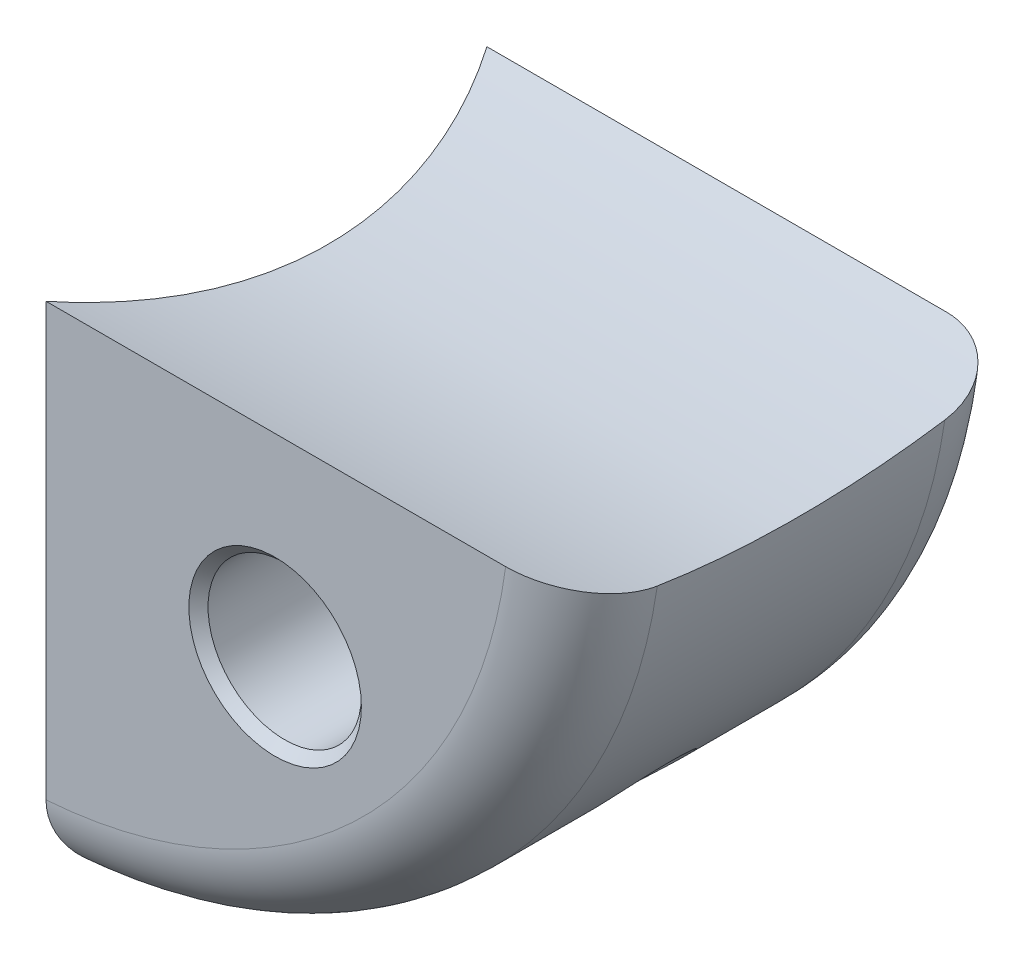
ISO-10303-21;
HEADER;
FILE_DESCRIPTION(('STEP AP214'),'2;1');
FILE_NAME('part.step','',(''),(''),'','','');
FILE_SCHEMA(('AUTOMOTIVE_DESIGN { 1 0 10303 214 1 1 1 1 }'));
ENDSEC;
DATA;
#1=APPLICATION_CONTEXT('core data for automotive mechanical design processes');
#2=APPLICATION_PROTOCOL_DEFINITION('international standard','automotive_design',2000,#1);
#3=PRODUCT_CONTEXT('',#1,'mechanical');
#4=PRODUCT('Part','Part','',(#3));
#5=PRODUCT_RELATED_PRODUCT_CATEGORY('part','',(#4));
#6=PRODUCT_DEFINITION_FORMATION('','',#4);
#7=PRODUCT_DEFINITION_CONTEXT('part definition',#1,'design');
#8=PRODUCT_DEFINITION('design','',#6,#7);
#9=PRODUCT_DEFINITION_SHAPE('','',#8);
#10=(LENGTH_UNIT() NAMED_UNIT(*) SI_UNIT(.MILLI.,.METRE.));
#11=(NAMED_UNIT(*) PLANE_ANGLE_UNIT() SI_UNIT($,.RADIAN.));
#12=(NAMED_UNIT(*) SI_UNIT($,.STERADIAN.) SOLID_ANGLE_UNIT());
#13=UNCERTAINTY_MEASURE_WITH_UNIT(LENGTH_MEASURE(1.E-05),#10,'distance_accuracy_value','');
#14=(GEOMETRIC_REPRESENTATION_CONTEXT(3) GLOBAL_UNCERTAINTY_ASSIGNED_CONTEXT((#13)) GLOBAL_UNIT_ASSIGNED_CONTEXT((#10,
#11,#12)) REPRESENTATION_CONTEXT('',''));
#15=CARTESIAN_POINT('',(0.,0.,0.));
#16=DIRECTION('',(0.,0.,1.));
#17=DIRECTION('',(1.,0.,0.));
#18=AXIS2_PLACEMENT_3D('',#15,#16,#17);
#19=CARTESIAN_POINT('',(0.,0.,23.));
#20=DIRECTION('',(0.,0.,-1.));
#21=DIRECTION('',(-1.,0.,0.));
#22=AXIS2_PLACEMENT_3D('',#19,#20,#21);
#23=CYLINDRICAL_SURFACE('',#22,60.);
#24=CARTESIAN_POINT('',(40.1556464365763,-44.5816560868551,-3.82644013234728));
#25=CARTESIAN_POINT('',(40.0194279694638,-44.7043511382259,-3.66433800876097));
#26=CARTESIAN_POINT('',(39.891639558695,-44.8183199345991,-3.48844085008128));
#27=CARTESIAN_POINT('',(39.6558741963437,-45.027064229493,-3.1133434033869));
#28=CARTESIAN_POINT('',(39.5479159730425,-45.1218215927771,-2.91412137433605));
#29=CARTESIAN_POINT('',(39.3405190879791,-45.3028164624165,-2.4672755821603));
#30=CARTESIAN_POINT('',(39.2444708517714,-45.3859300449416,-2.21679667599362));
#31=CARTESIAN_POINT('',(39.0841918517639,-45.5240287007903,-1.69850117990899));
#32=CARTESIAN_POINT('',(39.0199702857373,-45.5790056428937,-1.43067960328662));
#33=CARTESIAN_POINT('',(38.9237164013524,-45.6612360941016,-0.876837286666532));
#34=CARTESIAN_POINT('',(38.8926884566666,-45.6876248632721,-0.590512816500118));
#35=CARTESIAN_POINT('',(38.8671349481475,-45.7093655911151,-0.015071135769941));
#36=CARTESIAN_POINT('',(38.8726118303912,-45.7047154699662,0.274046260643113));
#37=CARTESIAN_POINT('',(38.9202490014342,-45.6641567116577,0.851163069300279));
#38=CARTESIAN_POINT('',(38.9629243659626,-45.6278091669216,1.13908951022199));
#39=CARTESIAN_POINT('',(39.0844026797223,-45.5237938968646,1.70137422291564));
#40=CARTESIAN_POINT('',(39.1632065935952,-45.4561253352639,1.9757321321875));
#41=CARTESIAN_POINT('',(39.3540106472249,-45.2910321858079,2.50117283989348));
#42=CARTESIAN_POINT('',(39.4658129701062,-45.1937848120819,2.75238295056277));
#43=CARTESIAN_POINT('',(39.7193724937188,-44.9710997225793,3.22552059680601));
#44=CARTESIAN_POINT('',(39.8611261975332,-44.8456652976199,3.44745154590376));
#45=CARTESIAN_POINT('',(40.166081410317,-44.5727113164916,3.84935488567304));
#46=CARTESIAN_POINT('',(40.3286336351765,-44.4258466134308,4.03026374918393));
#47=CARTESIAN_POINT('',(40.6727442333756,-44.1110201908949,4.35100856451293));
#48=CARTESIAN_POINT('',(40.8542978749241,-43.9430637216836,4.49085470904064));
#49=CARTESIAN_POINT('',(41.2230256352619,-43.5972873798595,4.71968777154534));
#50=CARTESIAN_POINT('',(41.4097005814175,-43.4201120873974,4.81045321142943));
#51=CARTESIAN_POINT('',(41.7891600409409,-43.055026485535,4.94590233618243));
#52=CARTESIAN_POINT('',(41.9819431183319,-42.8671186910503,4.99059677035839));
#53=CARTESIAN_POINT('',(42.3609745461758,-42.4925457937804,5.03149968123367));
#54=CARTESIAN_POINT('',(42.5472236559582,-42.306053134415,5.02929502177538));
#55=CARTESIAN_POINT('',(42.9143273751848,-41.9336245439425,4.98037546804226));
#56=CARTESIAN_POINT('',(43.095182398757,-41.7476885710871,4.93366399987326));
#57=CARTESIAN_POINT('',(43.4450865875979,-41.3834238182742,4.79799474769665));
#58=CARTESIAN_POINT('',(43.6142219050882,-41.205044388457,4.70939387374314));
#59=CARTESIAN_POINT('',(43.9382087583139,-40.859393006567,4.49309926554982));
#60=CARTESIAN_POINT('',(44.0930591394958,-40.6921219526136,4.36540237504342));
#61=CARTESIAN_POINT('',(44.3882107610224,-40.3699832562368,4.07187342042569));
#62=CARTESIAN_POINT('',(44.5281323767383,-40.2154552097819,3.90528782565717));
#63=CARTESIAN_POINT('',(44.7867940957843,-39.9271920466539,3.54067500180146));
#64=CARTESIAN_POINT('',(44.9055305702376,-39.7934604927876,3.34264239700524));
#65=CARTESIAN_POINT('',(45.1238100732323,-39.5457975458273,2.91278095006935));
#66=CARTESIAN_POINT('',(45.2224608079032,-39.4328026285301,2.67995949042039));
#67=CARTESIAN_POINT('',(45.3931347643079,-39.2362118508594,2.19311673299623));
#68=CARTESIAN_POINT('',(45.4651532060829,-39.1526212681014,1.93909163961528));
#69=CARTESIAN_POINT('',(45.5835553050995,-39.0147164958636,1.40743476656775));
#70=CARTESIAN_POINT('',(45.6289456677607,-38.9615383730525,1.1292864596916));
#71=CARTESIAN_POINT('',(45.6893880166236,-38.8906416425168,0.565274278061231));
#72=CARTESIAN_POINT('',(45.7044361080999,-38.8729275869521,0.279409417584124));
#73=CARTESIAN_POINT('',(45.7039714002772,-38.8734745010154,-0.298017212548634));
#74=CARTESIAN_POINT('',(45.6878399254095,-38.8924637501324,-0.589578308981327));
#75=CARTESIAN_POINT('',(45.6240097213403,-38.9673212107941,-1.16441523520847));
#76=CARTESIAN_POINT('',(45.5763094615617,-39.0231912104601,-1.44769066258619));
#77=CARTESIAN_POINT('',(45.450022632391,-39.1702027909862,-1.99793820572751));
#78=CARTESIAN_POINT('',(45.3714183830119,-39.2613645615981,-2.26490088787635));
#79=CARTESIAN_POINT('',(45.1846090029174,-39.4762116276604,-2.77429101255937));
#80=CARTESIAN_POINT('',(45.0764058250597,-39.5998947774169,-3.01672007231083));
#81=CARTESIAN_POINT('',(44.8348128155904,-39.8731999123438,-3.46480361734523));
#82=CARTESIAN_POINT('',(44.7019611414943,-40.0222629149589,-3.67108846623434));
#83=CARTESIAN_POINT('',(44.4124699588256,-40.3432655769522,-4.04570695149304));
#84=CARTESIAN_POINT('',(44.2558355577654,-40.5152003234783,-4.21404871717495));
#85=CARTESIAN_POINT('',(43.9286063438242,-40.8697140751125,-4.50135735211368));
#86=CARTESIAN_POINT('',(43.7587278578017,-41.0516772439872,-4.62189934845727));
#87=CARTESIAN_POINT('',(43.4047118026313,-41.4258032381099,-4.81768810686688));
#88=CARTESIAN_POINT('',(43.2205782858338,-41.6179631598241,-4.89294768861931));
#89=CARTESIAN_POINT('',(42.8505125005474,-41.9988260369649,-4.99334203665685));
#90=CARTESIAN_POINT('',(42.6649156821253,-42.1873820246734,-5.02027626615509));
#91=CARTESIAN_POINT('',(42.2906887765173,-42.5625163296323,-5.02858290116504));
#92=CARTESIAN_POINT('',(42.1020586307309,-42.7490946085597,-5.00995442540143));
#93=CARTESIAN_POINT('',(41.7307585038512,-43.1115994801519,-4.92856884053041));
#94=CARTESIAN_POINT('',(41.5480420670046,-43.2876558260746,-4.86659502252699));
#95=CARTESIAN_POINT('',(41.1905550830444,-43.6279615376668,-4.70154733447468));
#96=CARTESIAN_POINT('',(41.0157791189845,-43.7922189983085,-4.59850196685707));
#97=CARTESIAN_POINT('',(40.7240826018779,-44.0633366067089,-4.387379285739));
#98=CARTESIAN_POINT('',(40.6041591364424,-44.1738250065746,-4.28796586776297));
#99=CARTESIAN_POINT('',(40.3730019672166,-44.3851913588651,-4.07063599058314));
#100=CARTESIAN_POINT('',(40.2617660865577,-44.4860717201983,-3.95272418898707));
#101=CARTESIAN_POINT('',(40.1556464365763,-44.5816560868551,-3.82644013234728));
#102=B_SPLINE_CURVE_WITH_KNOTS('',3,(#24,#25,#26,#27,#28,#29,#30,#31,#32,#33,#34,#35,#36,#37,
#38,#39,#40,#41,#42,#43,#44,#45,#46,#47,#48,#49,#50,#51,#52,#53,#54,#55,#56,#57,#58,#59,#60,#61,
#62,#63,#64,#65,#66,#67,#68,#69,#70,#71,#72,#73,#74,#75,#76,#77,#78,#79,#80,#81,#82,#83,#84,#85,
#86,#87,#88,#89,#90,#91,#92,#93,#94,#95,#96,#97,#98,#99,#100,#101),.UNSPECIFIED.,.T.,.F.,(4,2,2,
2,2,2,2,2,2,2,2,2,2,2,2,2,2,2,2,2,2,2,2,2,2,2,2,2,2,2,2,2,2,2,2,2,2,2,4),(0.,0.733605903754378,
1.46790112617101,2.30653706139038,3.14541521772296,4.0090146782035,4.87267200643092,
5.74848157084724,6.62431452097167,7.49500017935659,8.36558423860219,9.21365960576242,
10.0615242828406,10.8761583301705,11.6906022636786,12.4775341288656,13.2644054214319,
14.0446899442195,14.8250374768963,15.6219869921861,16.4190728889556,17.2462072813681,
18.0734900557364,18.9299394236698,19.7864987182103,20.6602287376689,21.5340011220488,
22.4082741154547,23.2824894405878,24.1394830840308,24.99629294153,25.8218935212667,
26.647260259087,27.4411999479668,28.2351549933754,29.0151212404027,29.7945471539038,
30.3661992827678,30.9377077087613),.UNSPECIFIED.);
#103=CARTESIAN_POINT('',(40.1556464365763,-44.5816560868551,-3.82644013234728));
#104=VERTEX_POINT('',#103);
#105=EDGE_CURVE('E11',#104,#104,#102,.T.);
#106=ORIENTED_EDGE('',*,*,#105,.T.);
#107=EDGE_LOOP('',(#106));
#108=FACE_BOUND('',#107,.T.);
#109=CARTESIAN_POINT('',(0.,0.,15.));
#110=DIRECTION('',(0.,0.,1.));
#111=DIRECTION('',(1.,0.,0.));
#112=AXIS2_PLACEMENT_3D('',#109,#110,#111);
#113=CIRCLE('',#112,60.);
#114=CARTESIAN_POINT('',(59.3708716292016,-8.66600265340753,15.));
#115=VERTEX_POINT('',#114);
#116=CARTESIAN_POINT('',(7.39570383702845,-59.5424517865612,15.));
#117=VERTEX_POINT('',#116);
#118=EDGE_CURVE('E135',#115,#117,#113,.F.);
#119=ORIENTED_EDGE('',*,*,#118,.T.);
#120=CARTESIAN_POINT('',(7.39570383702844,-59.5424517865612,15.));
#121=CARTESIAN_POINT('',(7.60763358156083,-59.516113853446,14.4080908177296));
#122=CARTESIAN_POINT('',(7.80701129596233,-59.4902142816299,13.8116717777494));
#123=CARTESIAN_POINT('',(8.18034214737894,-59.4400364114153,12.6108518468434));
#124=CARTESIAN_POINT('',(8.35429489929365,-59.4157581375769,12.0064508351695));
#125=CARTESIAN_POINT('',(8.6764468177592,-59.3695685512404,10.7907305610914));
#126=CARTESIAN_POINT('',(8.82464631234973,-59.3476572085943,10.1794113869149));
#127=CARTESIAN_POINT('',(9.09501545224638,-59.3068232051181,8.95099369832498));
#128=CARTESIAN_POINT('',(9.21718537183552,-59.2879005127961,8.33389524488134));
#129=CARTESIAN_POINT('',(9.53807379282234,-59.237422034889,6.51081378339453));
#130=CARTESIAN_POINT('',(9.70039275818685,-59.2107720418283,5.29806269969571));
#131=CARTESIAN_POINT('',(9.92461772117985,-59.1735975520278,2.86328017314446));
#132=CARTESIAN_POINT('',(9.98652857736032,-59.1630722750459,1.64124918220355));
#133=CARTESIAN_POINT('',(10.0101679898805,-59.1590818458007,-0.871473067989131));
#134=CARTESIAN_POINT('',(9.9661660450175,-59.1665924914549,-2.16222348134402));
#135=CARTESIAN_POINT('',(9.76616580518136,-59.1999360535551,-4.73511544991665));
#136=CARTESIAN_POINT('',(9.61015082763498,-59.2257716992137,-6.01725569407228));
#137=CARTESIAN_POINT('',(9.28993657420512,-59.2765433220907,-7.94570103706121));
#138=CARTESIAN_POINT('',(9.16631178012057,-59.295852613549,-8.59915088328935));
#139=CARTESIAN_POINT('',(8.88992626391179,-59.3379211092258,-9.89980632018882));
#140=CARTESIAN_POINT('',(8.73716511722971,-59.3606803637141,-10.5470118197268));
#141=CARTESIAN_POINT('',(8.40283788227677,-59.4089297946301,-11.8337809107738));
#142=CARTESIAN_POINT('',(8.22127351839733,-59.434419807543,-12.4733449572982));
#143=CARTESIAN_POINT('',(7.82971584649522,-59.4872592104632,-13.7436191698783));
#144=CARTESIAN_POINT('',(7.61972310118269,-59.5146085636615,-14.3743295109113));
#145=CARTESIAN_POINT('',(7.39570383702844,-59.5424517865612,-15.));
#146=B_SPLINE_CURVE_WITH_KNOTS('',3,(#120,#121,#122,#123,#124,#125,#126,#127,#128,#129,#130,
#131,#132,#133,#134,#135,#136,#137,#138,#139,#140,#141,#142,#143,#144,#145),.UNSPECIFIED.,.F.,
.F.,(4,2,2,2,2,2,2,2,2,2,2,2,4),(0.,1.88762212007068,3.77527282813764,5.66289948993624,
7.55050626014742,11.2174558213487,14.8842279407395,18.7538099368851,22.6239683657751,
24.6193703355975,26.6148013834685,28.6101130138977,30.6053851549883),.UNSPECIFIED.);
#147=CARTESIAN_POINT('',(7.39570383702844,-59.5424517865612,-15.));
#148=VERTEX_POINT('',#147);
#149=EDGE_CURVE('E86',#117,#148,#146,.T.);
#150=ORIENTED_EDGE('',*,*,#149,.T.);
#151=CARTESIAN_POINT('',(0.,0.,-15.));
#152=DIRECTION('',(0.,0.,1.));
#153=DIRECTION('',(1.,0.,0.));
#154=AXIS2_PLACEMENT_3D('',#151,#152,#153);
#155=CIRCLE('',#154,60.);
#156=CARTESIAN_POINT('',(59.3708716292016,-8.66600265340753,-15.));
#157=VERTEX_POINT('',#156);
#158=EDGE_CURVE('E60',#148,#157,#155,.T.);
#159=ORIENTED_EDGE('',*,*,#158,.T.);
#160=CARTESIAN_POINT('',(59.3708716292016,-8.66600265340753,-15.));
#161=CARTESIAN_POINT('',(59.3546224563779,-8.77730108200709,-14.3792062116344));
#162=CARTESIAN_POINT('',(59.3390700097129,-8.88168951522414,-13.7571771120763));
#163=CARTESIAN_POINT('',(59.3095700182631,-9.0766015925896,-12.5109109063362));
#164=CARTESIAN_POINT('',(59.2956224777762,-9.16712519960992,-11.8866737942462));
#165=CARTESIAN_POINT('',(59.2565059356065,-9.41782165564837,-10.0111173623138));
#166=CARTESIAN_POINT('',(59.2340611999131,-9.55713225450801,-8.7568853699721));
#167=CARTESIAN_POINT('',(59.197851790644,-9.77889596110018,-6.25343266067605));
#168=CARTESIAN_POINT('',(59.1840191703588,-9.86179463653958,-5.00425202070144));
#169=CARTESIAN_POINT('',(59.1654922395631,-9.97234635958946,-2.50338090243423));
#170=CARTESIAN_POINT('',(59.1607978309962,-9.99999999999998,-1.25169045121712));
#171=CARTESIAN_POINT('',(59.1607978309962,-9.99999999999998,1.25169045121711));
#172=CARTESIAN_POINT('',(59.1654922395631,-9.97234635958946,2.50338090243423));
#173=CARTESIAN_POINT('',(59.1840191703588,-9.86179463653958,5.00425202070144));
#174=CARTESIAN_POINT('',(59.197851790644,-9.77889596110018,6.25343266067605));
#175=CARTESIAN_POINT('',(59.2340611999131,-9.55713225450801,8.75688536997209));
#176=CARTESIAN_POINT('',(59.2565059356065,-9.41782165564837,10.0111173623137));
#177=CARTESIAN_POINT('',(59.2956224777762,-9.16712519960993,11.8866737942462));
#178=CARTESIAN_POINT('',(59.3095700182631,-9.0766015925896,12.5109109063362));
#179=CARTESIAN_POINT('',(59.3390700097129,-8.88168951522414,13.7571771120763));
#180=CARTESIAN_POINT('',(59.3546224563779,-8.77730108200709,14.3792062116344));
#181=CARTESIAN_POINT('',(59.3708716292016,-8.66600265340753,15.));
#182=B_SPLINE_CURVE_WITH_KNOTS('',3,(#160,#161,#162,#163,#164,#165,#166,#167,#168,#169,#170,
#171,#172,#173,#174,#175,#176,#177,#178,#179,#180,#181),.UNSPECIFIED.,.F.,.F.,(4,2,2,2,2,2,2,2,
2,2,4),(0.,1.8926209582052,3.78524698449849,7.57029319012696,11.3250851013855,15.0798367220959,
18.8345883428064,22.5893802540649,26.3744264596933,28.2670524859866,30.1596734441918),.UNSPECIFIED.);
#183=EDGE_CURVE('E125',#157,#115,#182,.T.);
#184=ORIENTED_EDGE('',*,*,#183,.T.);
#185=EDGE_LOOP('',(#119,#150,#159,#184));
#186=FACE_BOUND('',#185,.T.);
#187=ADVANCED_FACE('F32',(#108,#186),#23,.T.);
#188=CARTESIAN_POINT('',(0.,0.,23.));
#189=DIRECTION('',(0.,0.,1.));
#190=DIRECTION('',(1.,0.,0.));
#191=AXIS2_PLACEMENT_3D('',#188,#189,#190);
#192=PLANE('',#191);
#193=CARTESIAN_POINT('',(27.5,-27.,23.));
#194=DIRECTION('',(0.,0.,1.));
#195=DIRECTION('',(1.,0.,0.));
#196=AXIS2_PLACEMENT_3D('',#193,#194,#195);
#197=CIRCLE('',#196,9.);
#198=CARTESIAN_POINT('',(36.5,-27.,23.));
#199=VERTEX_POINT('',#198);
#200=EDGE_CURVE('E195',#199,#199,#197,.T.);
#201=ORIENTED_EDGE('',*,*,#200,.F.);
#202=EDGE_LOOP('',(#201));
#203=FACE_BOUND('',#202,.T.);
#204=DIRECTION('',(0.,1.,0.));
#205=VECTOR('',#204,1.);
#206=CARTESIAN_POINT('',(3.59527529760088,-60.,23.));
#207=LINE('',#206,#205);
#208=CARTESIAN_POINT('',(3.59527529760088,-51.8755626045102,23.));
#209=VERTEX_POINT('',#208);
#210=CARTESIAN_POINT('',(3.59527529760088,-6.82909018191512,23.));
#211=VERTEX_POINT('',#210);
#212=EDGE_CURVE('E52',#209,#211,#207,.T.);
#213=ORIENTED_EDGE('',*,*,#212,.F.);
#214=CARTESIAN_POINT('',(0.,0.,23.));
#215=DIRECTION('',(0.,0.,1.));
#216=DIRECTION('',(1.,0.,0.));
#217=AXIS2_PLACEMENT_3D('',#214,#215,#216);
#218=CIRCLE('',#217,52.);
#219=CARTESIAN_POINT('',(51.5496219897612,-6.82909018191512,23.));
#220=VERTEX_POINT('',#219);
#221=EDGE_CURVE('E96',#209,#220,#218,.T.);
#222=ORIENTED_EDGE('',*,*,#221,.T.);
#223=DIRECTION('',(1.,0.,0.));
#224=VECTOR('',#223,1.);
#225=CARTESIAN_POINT('',(-60.,-6.82909018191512,23.));
#226=LINE('',#225,#224);
#227=EDGE_CURVE('E98',#211,#220,#226,.T.);
#228=ORIENTED_EDGE('',*,*,#227,.F.);
#229=EDGE_LOOP('',(#213,#222,#228));
#230=FACE_BOUND('',#229,.T.);
#231=ADVANCED_FACE('F95',(#203,#230),#192,.T.);
#232=CARTESIAN_POINT('',(0.,0.,-23.));
#233=DIRECTION('',(0.,0.,1.));
#234=DIRECTION('',(1.,0.,0.));
#235=AXIS2_PLACEMENT_3D('',#232,#233,#234);
#236=PLANE('',#235);
#237=CARTESIAN_POINT('',(27.5,-27.,-23.));
#238=DIRECTION('',(0.,0.,1.));
#239=DIRECTION('',(1.,0.,0.));
#240=AXIS2_PLACEMENT_3D('',#237,#238,#239);
#241=CIRCLE('',#240,8.53248222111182);
#242=CARTESIAN_POINT('',(36.0324822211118,-27.,-23.));
#243=VERTEX_POINT('',#242);
#244=EDGE_CURVE('E99',#243,#243,#241,.T.);
#245=ORIENTED_EDGE('',*,*,#244,.T.);
#246=EDGE_LOOP('',(#245));
#247=FACE_BOUND('',#246,.T.);
#248=CARTESIAN_POINT('',(0.,0.,-23.));
#249=DIRECTION('',(0.,0.,1.));
#250=DIRECTION('',(1.,0.,0.));
#251=AXIS2_PLACEMENT_3D('',#248,#249,#250);
#252=CIRCLE('',#251,52.);
#253=CARTESIAN_POINT('',(51.5496219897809,-6.82909018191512,-23.));
#254=VERTEX_POINT('',#253);
#255=CARTESIAN_POINT('',(3.59527529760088,-51.8755626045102,-23.));
#256=VERTEX_POINT('',#255);
#257=EDGE_CURVE('E103',#254,#256,#252,.F.);
#258=ORIENTED_EDGE('',*,*,#257,.T.);
#259=DIRECTION('',(0.,1.,0.));
#260=VECTOR('',#259,1.);
#261=CARTESIAN_POINT('',(3.59527529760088,-60.,-23.));
#262=LINE('',#261,#260);
#263=CARTESIAN_POINT('',(3.59527529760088,-6.82909018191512,-23.));
#264=VERTEX_POINT('',#263);
#265=EDGE_CURVE('E91',#256,#264,#262,.T.);
#266=ORIENTED_EDGE('',*,*,#265,.T.);
#267=DIRECTION('',(1.,0.,0.));
#268=VECTOR('',#267,1.);
#269=CARTESIAN_POINT('',(-60.,-6.82909018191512,-23.));
#270=LINE('',#269,#268);
#271=EDGE_CURVE('E123',#264,#254,#270,.T.);
#272=ORIENTED_EDGE('',*,*,#271,.T.);
#273=EDGE_LOOP('',(#258,#266,#272));
#274=FACE_BOUND('',#273,.T.);
#275=ADVANCED_FACE('F164',(#247,#274),#236,.F.);
#276=CARTESIAN_POINT('',(0.,0.,-15.));
#277=DIRECTION('',(0.,0.,1.));
#278=DIRECTION('',(1.,0.,0.));
#279=AXIS2_PLACEMENT_3D('',#276,#277,#278);
#280=TOROIDAL_SURFACE('',#279,52.,8.);
#281=CARTESIAN_POINT('',(7.56022792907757,-43.3595128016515,-14.5322822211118));
#282=CARTESIAN_POINT('',(7.4744160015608,-43.3596952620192,-14.7807169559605));
#283=CARTESIAN_POINT('',(7.38639347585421,-43.3718945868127,-15.0282766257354));
#284=CARTESIAN_POINT('',(7.20679681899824,-43.4191813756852,-15.5196944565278));
#285=CARTESIAN_POINT('',(7.11522547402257,-43.4542512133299,-15.7635553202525));
#286=CARTESIAN_POINT('',(6.92962305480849,-43.5459608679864,-16.2450862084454));
#287=CARTESIAN_POINT('',(6.83560277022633,-43.6025173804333,-16.4827764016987));
#288=CARTESIAN_POINT('',(6.64557885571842,-43.7360897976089,-16.9515574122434));
#289=CARTESIAN_POINT('',(6.54957483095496,-43.8131098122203,-17.1826468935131));
#290=CARTESIAN_POINT('',(6.35674184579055,-43.9862871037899,-17.6362458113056));
#291=CARTESIAN_POINT('',(6.25991634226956,-44.0823846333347,-17.8587795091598));
#292=CARTESIAN_POINT('',(6.06607726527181,-44.2928479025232,-18.2948200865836));
#293=CARTESIAN_POINT('',(5.9690637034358,-44.4072125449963,-18.5083275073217));
#294=CARTESIAN_POINT('',(5.67866600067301,-44.777006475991,-19.1346793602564));
#295=CARTESIAN_POINT('',(5.48614560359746,-45.058937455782,-19.5328387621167));
#296=CARTESIAN_POINT('',(5.19789079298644,-45.5431491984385,-20.1091850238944));
#297=CARTESIAN_POINT('',(5.09812947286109,-45.7229567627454,-20.3047503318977));
#298=CARTESIAN_POINT('',(4.90338440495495,-46.1007213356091,-20.6801347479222));
#299=CARTESIAN_POINT('',(4.80840126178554,-46.2986806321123,-20.8599518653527));
#300=CARTESIAN_POINT('',(4.53339002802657,-46.9180578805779,-21.3727439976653));
#301=CARTESIAN_POINT('',(4.36277557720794,-47.3658363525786,-21.6800922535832));
#302=CARTESIAN_POINT('',(4.09746068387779,-48.2109599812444,-22.1481677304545));
#303=CARTESIAN_POINT('',(3.99432937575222,-48.5960027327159,-22.3263656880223));
#304=CARTESIAN_POINT('',(3.86349743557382,-49.1948098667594,-22.5499319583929));
#305=CARTESIAN_POINT('',(3.82386242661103,-49.397967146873,-22.6171686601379));
#306=CARTESIAN_POINT('',(3.75338442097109,-49.8103109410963,-22.7361693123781));
#307=CARTESIAN_POINT('',(3.72254161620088,-50.019497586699,-22.7879329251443));
#308=CARTESIAN_POINT('',(3.67027753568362,-50.4437481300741,-22.8753694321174));
#309=CARTESIAN_POINT('',(3.64891589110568,-50.6588404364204,-22.9109405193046));
#310=CARTESIAN_POINT('',(3.61651375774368,-51.0919652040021,-22.9648073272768));
#311=CARTESIAN_POINT('',(3.60547331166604,-51.3099976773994,-22.9831029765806));
#312=CARTESIAN_POINT('',(3.59410855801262,-51.7470467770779,-23.0019350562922));
#313=CARTESIAN_POINT('',(3.59378094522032,-51.9660630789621,-23.0024769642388));
#314=CARTESIAN_POINT('',(3.60395602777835,-52.4031434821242,-22.9856180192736));
#315=CARTESIAN_POINT('',(3.61445775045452,-52.6212076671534,-22.9682187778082));
#316=CARTESIAN_POINT('',(3.64448165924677,-53.0319537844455,-22.9183170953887));
#317=CARTESIAN_POINT('',(3.66295828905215,-53.2249278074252,-22.8875632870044));
#318=CARTESIAN_POINT('',(3.70818089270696,-53.6071854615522,-22.8119892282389));
#319=CARTESIAN_POINT('',(3.73492965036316,-53.7964678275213,-22.7671642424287));
#320=CARTESIAN_POINT('',(3.7962255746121,-54.169898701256,-22.6639075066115));
#321=CARTESIAN_POINT('',(3.83076966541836,-54.3540492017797,-22.6054811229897));
#322=CARTESIAN_POINT('',(3.9070991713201,-54.7162038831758,-22.4755513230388));
#323=CARTESIAN_POINT('',(3.94888737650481,-54.8942056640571,-22.4040428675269));
#324=CARTESIAN_POINT('',(4.03919947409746,-55.2436195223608,-22.248330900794));
#325=CARTESIAN_POINT('',(4.08774780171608,-55.4150046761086,-22.1640812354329));
#326=CARTESIAN_POINT('',(4.19075336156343,-55.7496617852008,-21.9837755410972));
#327=CARTESIAN_POINT('',(4.24521269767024,-55.9129308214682,-21.8877153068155));
#328=CARTESIAN_POINT('',(4.35927260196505,-56.2305359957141,-21.6845678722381));
#329=CARTESIAN_POINT('',(4.41887246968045,-56.3848733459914,-21.5774821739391));
#330=CARTESIAN_POINT('',(4.54247345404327,-56.6840430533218,-21.3530261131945));
#331=CARTESIAN_POINT('',(4.60647615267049,-56.8288719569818,-21.235652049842));
#332=CARTESIAN_POINT('',(4.81661735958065,-57.2750958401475,-20.8457621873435));
#333=CARTESIAN_POINT('',(4.96980418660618,-57.5575539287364,-20.5549456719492));
#334=CARTESIAN_POINT('',(5.28647511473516,-58.0698296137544,-19.9350801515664));
#335=CARTESIAN_POINT('',(5.4499641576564,-58.2996216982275,-19.60601273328));
#336=CARTESIAN_POINT('',(5.70646209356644,-58.6128114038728,-19.0718391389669));
#337=CARTESIAN_POINT('',(5.79821784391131,-58.7156615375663,-18.8772779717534));
#338=CARTESIAN_POINT('',(5.98192345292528,-58.9039879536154,-18.4800341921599));
#339=CARTESIAN_POINT('',(6.07387325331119,-58.9894688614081,-18.277353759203));
#340=CARTESIAN_POINT('',(6.25710219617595,-59.1427018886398,-17.8650373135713));
#341=CARTESIAN_POINT('',(6.34838111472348,-59.2104483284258,-17.6553990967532));
#342=CARTESIAN_POINT('',(6.52939510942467,-59.3278243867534,-17.2305545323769));
#343=CARTESIAN_POINT('',(6.61913079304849,-59.3774612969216,-17.015350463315));
#344=CARTESIAN_POINT('',(6.78309886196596,-59.4523165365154,-16.6131162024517));
#345=CARTESIAN_POINT('',(6.85764415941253,-59.4800753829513,-16.4266813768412));
#346=CARTESIAN_POINT('',(7.00468995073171,-59.5221608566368,-16.0515203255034));
#347=CARTESIAN_POINT('',(7.07719067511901,-59.5364890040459,-15.8627943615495));
#348=CARTESIAN_POINT('',(7.21972557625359,-59.5515985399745,-15.4840355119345));
#349=CARTESIAN_POINT('',(7.28976155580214,-59.5523900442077,-15.2940037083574));
#350=CARTESIAN_POINT('',(7.42711612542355,-59.5403932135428,-14.9133528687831));
#351=CARTESIAN_POINT('',(7.49443426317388,-59.5276026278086,-14.7227337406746));
#352=CARTESIAN_POINT('',(7.56022792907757,-59.5079913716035,-14.5322822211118));
#353=B_SPLINE_CURVE_WITH_KNOTS('',3,(#281,#282,#283,#284,#285,#286,#287,#288,#289,#290,#291,
#292,#293,#294,#295,#296,#297,#298,#299,#300,#301,#302,#303,#304,#305,#306,#307,#308,#309,#310,
#311,#312,#313,#314,#315,#316,#317,#318,#319,#320,#321,#322,#323,#324,#325,#326,#327,#328,#329,
#330,#331,#332,#333,#334,#335,#336,#337,#338,#339,#340,#341,#342,#343,#344,#345,#346,#347,#348,
#349,#350,#351,#352),.UNSPECIFIED.,.F.,.F.,(4,2,2,2,2,2,2,2,2,2,2,2,2,2,2,2,2,2,2,2,2,2,2,2,2,2,
2,2,2,2,2,2,2,2,2,4),(0.,0.788088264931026,1.57556986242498,2.36002901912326,3.14464584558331,
3.9268430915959,4.70899337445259,6.27505810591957,7.12549860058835,7.97604643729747,
9.67287036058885,10.9770931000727,11.6292923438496,12.2815058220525,12.9377651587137,
13.5940272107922,14.2500867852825,14.9060874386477,15.4942247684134,16.0825602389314,
16.6706639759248,17.2589947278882,17.8495101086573,18.4402363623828,19.0308822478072,
19.621741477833,20.9162200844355,22.2113244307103,22.9259606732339,23.6404063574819,
24.3550805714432,25.0694667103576,25.677101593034,26.2846676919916,26.8917797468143,
27.498992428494),.UNSPECIFIED.);
#354=EDGE_CURVE('E177',#256,#148,#353,.T.);
#355=ORIENTED_EDGE('',*,*,#354,.F.);
#356=ORIENTED_EDGE('',*,*,#257,.F.);
#357=CARTESIAN_POINT('',(59.370866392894,-8.66603851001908,-14.9998));
#358=CARTESIAN_POINT('',(59.3767887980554,-8.62565952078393,-15.2250785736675));
#359=CARTESIAN_POINT('',(59.3731495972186,-8.58430921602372,-15.4504341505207));
#360=CARTESIAN_POINT('',(59.3468277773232,-8.50000214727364,-15.8997316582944));
#361=CARTESIAN_POINT('',(59.3241448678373,-8.45704535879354,-16.1236735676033));
#362=CARTESIAN_POINT('',(59.2598127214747,-8.36985932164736,-16.5685865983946));
#363=CARTESIAN_POINT('',(59.2181619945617,-8.3256299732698,-16.7895574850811));
#364=CARTESIAN_POINT('',(59.1161267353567,-8.23630271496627,-17.2269470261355));
#365=CARTESIAN_POINT('',(59.0557426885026,-8.19120482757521,-17.4433657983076));
#366=CARTESIAN_POINT('',(58.9165281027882,-8.10054433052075,-17.8702882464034));
#367=CARTESIAN_POINT('',(58.8376828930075,-8.05498137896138,-18.080787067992));
#368=CARTESIAN_POINT('',(58.6620399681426,-7.96390982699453,-18.4941738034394));
#369=CARTESIAN_POINT('',(58.5652421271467,-7.9184012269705,-18.6970616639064));
#370=CARTESIAN_POINT('',(58.354328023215,-7.82797465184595,-19.0936631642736));
#371=CARTESIAN_POINT('',(58.2402184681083,-7.78305645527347,-19.2873803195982));
#372=CARTESIAN_POINT('',(57.9953753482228,-7.69433846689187,-19.6642790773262));
#373=CARTESIAN_POINT('',(57.8646420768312,-7.65053865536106,-19.8474608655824));
#374=CARTESIAN_POINT('',(57.5891707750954,-7.56516782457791,-20.1996406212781));
#375=CARTESIAN_POINT('',(57.4446323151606,-7.52357552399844,-20.3687895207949));
#376=CARTESIAN_POINT('',(57.1411366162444,-7.44257965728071,-20.6941821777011));
#377=CARTESIAN_POINT('',(56.9821797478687,-7.40317603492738,-20.8504262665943));
#378=CARTESIAN_POINT('',(56.6509169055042,-7.3270991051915,-21.148817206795));
#379=CARTESIAN_POINT('',(56.4786100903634,-7.29042597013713,-21.2909631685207));
#380=CARTESIAN_POINT('',(56.1218721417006,-7.22034070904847,-21.5600303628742));
#381=CARTESIAN_POINT('',(55.9374412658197,-7.18692851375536,-21.6869519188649));
#382=CARTESIAN_POINT('',(55.562613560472,-7.12466031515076,-21.9215539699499));
#383=CARTESIAN_POINT('',(55.3724864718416,-7.09571028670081,-22.0296406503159));
#384=CARTESIAN_POINT('',(54.983345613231,-7.04179513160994,-22.2295879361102));
#385=CARTESIAN_POINT('',(54.7843320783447,-7.01682989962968,-22.3214489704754));
#386=CARTESIAN_POINT('',(54.3789036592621,-6.9712503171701,-22.4882547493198));
#387=CARTESIAN_POINT('',(54.1724902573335,-6.95063510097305,-22.5632028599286));
#388=CARTESIAN_POINT('',(53.7537486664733,-6.91404500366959,-22.6956815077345));
#389=CARTESIAN_POINT('',(53.5414205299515,-6.89807008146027,-22.7532121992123));
#390=CARTESIAN_POINT('',(53.116338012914,-6.87122719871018,-22.849608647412));
#391=CARTESIAN_POINT('',(52.9036618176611,-6.8602715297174,-22.888795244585));
#392=CARTESIAN_POINT('',(52.4755760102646,-6.84317283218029,-22.949859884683));
#393=CARTESIAN_POINT('',(52.2601654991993,-6.83703143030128,-22.9717320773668));
#394=CARTESIAN_POINT('',(51.8282428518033,-6.82962031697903,-22.9981178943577));
#395=CARTESIAN_POINT('',(51.6117309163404,-6.82834974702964,-23.0026345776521));
#396=CARTESIAN_POINT('',(51.1790544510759,-6.83065135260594,-22.9944453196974));
#397=CARTESIAN_POINT('',(50.9628899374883,-6.83422374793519,-22.9817385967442));
#398=CARTESIAN_POINT('',(50.5299475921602,-6.84617735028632,-22.9391313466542));
#399=CARTESIAN_POINT('',(50.3131901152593,-6.85461208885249,-22.9090394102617));
#400=CARTESIAN_POINT('',(49.8829458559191,-6.87615554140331,-22.8319239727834));
#401=CARTESIAN_POINT('',(49.6694591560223,-6.88926437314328,-22.7849000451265));
#402=CARTESIAN_POINT('',(49.247113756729,-6.91991809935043,-22.6744415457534));
#403=CARTESIAN_POINT('',(49.0382548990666,-6.93746284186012,-22.6110075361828));
#404=CARTESIAN_POINT('',(48.6263424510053,-6.97670627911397,-22.4683132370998));
#405=CARTESIAN_POINT('',(48.4232909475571,-6.99840644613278,-22.3890473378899));
#406=CARTESIAN_POINT('',(48.0151329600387,-7.04670408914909,-22.2114204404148));
#407=CARTESIAN_POINT('',(47.810354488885,-7.07347967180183,-22.1123538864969));
#408=CARTESIAN_POINT('',(47.4096616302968,-7.13080462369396,-21.8984745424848));
#409=CARTESIAN_POINT('',(47.2137503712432,-7.16135531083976,-21.783656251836));
#410=CARTESIAN_POINT('',(46.8319963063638,-7.22578594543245,-21.5391759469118));
#411=CARTESIAN_POINT('',(46.6461536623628,-7.25966594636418,-21.4095136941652));
#412=CARTESIAN_POINT('',(46.285589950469,-7.33030231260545,-21.1362539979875));
#413=CARTESIAN_POINT('',(46.1108693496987,-7.3670587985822,-20.9926559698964));
#414=CARTESIAN_POINT('',(45.7641246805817,-7.44510720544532,-20.6840762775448));
#415=CARTESIAN_POINT('',(45.5927951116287,-7.4865377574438,-20.5183485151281));
#416=CARTESIAN_POINT('',(45.2647968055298,-7.57153394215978,-20.173579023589));
#417=CARTESIAN_POINT('',(45.108123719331,-7.61509893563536,-19.9945412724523));
#418=CARTESIAN_POINT('',(44.8102871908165,-7.70387967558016,-19.6240820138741));
#419=CARTESIAN_POINT('',(44.6691389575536,-7.74909698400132,-19.4326486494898));
#420=CARTESIAN_POINT('',(44.4036025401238,-7.84059113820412,-19.0388367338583));
#421=CARTESIAN_POINT('',(44.2792080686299,-7.88686757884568,-18.83646232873));
#422=CARTESIAN_POINT('',(44.0454496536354,-7.98104601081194,-18.417198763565));
#423=CARTESIAN_POINT('',(43.9364970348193,-8.02896091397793,-18.2000828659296));
#424=CARTESIAN_POINT('',(43.7381737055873,-8.12480691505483,-17.7571895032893));
#425=CARTESIAN_POINT('',(43.6487949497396,-8.17273799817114,-17.5314156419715));
#426=CARTESIAN_POINT('',(43.4906658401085,-8.26803253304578,-17.0730624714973));
#427=CARTESIAN_POINT('',(43.4218822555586,-8.31539677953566,-16.8404947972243));
#428=CARTESIAN_POINT('',(43.3056729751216,-8.40911642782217,-16.3699959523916));
#429=CARTESIAN_POINT('',(43.2582345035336,-8.4554724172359,-16.1320680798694));
#430=CARTESIAN_POINT('',(43.1993985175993,-8.52922258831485,-15.7445747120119));
#431=CARTESIAN_POINT('',(43.1811561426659,-8.55707271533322,-15.5961047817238));
#432=CARTESIAN_POINT('',(43.1532242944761,-8.61208472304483,-15.2984384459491));
#433=CARTESIAN_POINT('',(43.1435237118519,-8.63924745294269,-15.1492432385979));
#434=CARTESIAN_POINT('',(43.1381475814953,-8.66603851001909,-14.9998));
#435=B_SPLINE_CURVE_WITH_KNOTS('',3,(#357,#358,#359,#360,#361,#362,#363,#364,#365,#366,#367,
#368,#369,#370,#371,#372,#373,#374,#375,#376,#377,#378,#379,#380,#381,#382,#383,#384,#385,#386,
#387,#388,#389,#390,#391,#392,#393,#394,#395,#396,#397,#398,#399,#400,#401,#402,#403,#404,#405,
#406,#407,#408,#409,#410,#411,#412,#413,#414,#415,#416,#417,#418,#419,#420,#421,#422,#423,#424,
#425,#426,#427,#428,#429,#430,#431,#432,#433,#434),.UNSPECIFIED.,.F.,.F.,(4,2,2,2,2,2,2,2,2,2,2,
2,2,2,2,2,2,2,2,2,2,2,2,2,2,2,2,2,2,2,2,2,2,2,2,2,2,2,4),(0.,0.68663664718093,1.37328376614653,
2.05998483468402,2.74666811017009,3.43389894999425,4.12113460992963,4.80810466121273,
5.49506259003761,6.17327141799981,6.85146281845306,7.52969698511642,8.20791674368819,
8.8689443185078,9.52995441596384,10.1908328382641,10.85170540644,11.5005423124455,
12.1495983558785,12.7985399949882,13.4475110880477,14.1037672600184,14.7600399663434,
15.4162901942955,16.0727733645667,16.7591723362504,17.4458116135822,18.1324619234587,
18.8191410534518,19.5441373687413,20.2689178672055,20.9944021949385,21.7196135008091,
22.461498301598,23.2030775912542,23.9434537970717,24.6833862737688,25.1396336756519,
25.5952868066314),.UNSPECIFIED.);
#436=EDGE_CURVE('E136',#157,#254,#435,.T.);
#437=ORIENTED_EDGE('',*,*,#436,.F.);
#438=ORIENTED_EDGE('',*,*,#158,.F.);
#439=EDGE_LOOP('',(#355,#356,#437,#438));
#440=FACE_BOUND('',#439,.T.);
#441=ADVANCED_FACE('F151',(#440),#280,.T.);
#442=CARTESIAN_POINT('',(0.,0.,15.));
#443=DIRECTION('',(0.,0.,1.));
#444=DIRECTION('',(1.,0.,0.));
#445=AXIS2_PLACEMENT_3D('',#442,#443,#444);
#446=TOROIDAL_SURFACE('',#445,52.,8.);
#447=CARTESIAN_POINT('',(7.55499431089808,-59.5095352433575,14.5474208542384));
#448=CARTESIAN_POINT('',(7.47336922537,-59.5334007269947,14.7834547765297));
#449=CARTESIAN_POINT('',(7.38939556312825,-59.5467782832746,15.0197195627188));
#450=CARTESIAN_POINT('',(7.21739744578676,-59.5526964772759,15.491002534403));
#451=CARTESIAN_POINT('',(7.12937348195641,-59.5452396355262,15.7260208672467));
#452=CARTESIAN_POINT('',(6.94992876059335,-59.5096391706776,16.1930884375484));
#453=CARTESIAN_POINT('',(6.85850905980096,-59.4815019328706,16.425138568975));
#454=CARTESIAN_POINT('',(6.67300470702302,-59.404804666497,16.8847583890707));
#455=CARTESIAN_POINT('',(6.57892001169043,-59.3562443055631,17.1123280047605));
#456=CARTESIAN_POINT('',(6.3889399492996,-59.2390280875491,17.5614363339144));
#457=CARTESIAN_POINT('',(6.29304471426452,-59.1703736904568,17.7829754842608));
#458=CARTESIAN_POINT('',(6.10034398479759,-59.0133274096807,18.2186394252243));
#459=CARTESIAN_POINT('',(6.00353818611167,-58.924928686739,18.432761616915));
#460=CARTESIAN_POINT('',(5.81009017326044,-58.7288564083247,18.8520539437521));
#461=CARTESIAN_POINT('',(5.71344794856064,-58.6211841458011,19.0572246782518));
#462=CARTESIAN_POINT('',(5.52145429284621,-58.3870663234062,19.4571942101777));
#463=CARTESIAN_POINT('',(5.42610280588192,-58.260621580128,19.6519934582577));
#464=CARTESIAN_POINT('',(5.23830635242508,-57.9900927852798,20.0290084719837));
#465=CARTESIAN_POINT('',(5.14585092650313,-57.8460844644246,20.2112733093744));
#466=CARTESIAN_POINT('',(4.96477936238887,-57.5407359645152,20.5625930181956));
#467=CARTESIAN_POINT('',(4.87616163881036,-57.3794030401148,20.7316533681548));
#468=CARTESIAN_POINT('',(4.70411869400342,-57.0401354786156,21.0551811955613));
#469=CARTESIAN_POINT('',(4.62069384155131,-56.8621996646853,21.209647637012));
#470=CARTESIAN_POINT('',(4.46052753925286,-56.4907181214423,21.5024451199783));
#471=CARTESIAN_POINT('',(4.38378548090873,-56.2971738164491,21.6407776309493));
#472=CARTESIAN_POINT('',(4.24355147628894,-55.9096312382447,21.8907817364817));
#473=CARTESIAN_POINT('',(4.17950968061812,-55.7165956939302,22.0036370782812));
#474=CARTESIAN_POINT('',(4.05977086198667,-55.319305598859,22.2128026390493));
#475=CARTESIAN_POINT('',(4.00407265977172,-55.11505263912,22.3091151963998));
#476=CARTESIAN_POINT('',(3.90223752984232,-54.6970016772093,22.4839585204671));
#477=CARTESIAN_POINT('',(3.85609178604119,-54.4832126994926,22.5625056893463));
#478=CARTESIAN_POINT('',(3.77435255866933,-54.047710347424,22.7008901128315));
#479=CARTESIAN_POINT('',(3.73875770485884,-53.8259980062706,22.7607297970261));
#480=CARTESIAN_POINT('',(3.68241965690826,-53.4027078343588,22.8550974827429));
#481=CARTESIAN_POINT('',(3.66043507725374,-53.2017662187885,22.8917522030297));
#482=CARTESIAN_POINT('',(3.62577551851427,-52.7968653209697,22.9494309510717));
#483=CARTESIAN_POINT('',(3.61309975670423,-52.5929062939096,22.9704562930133));
#484=CARTESIAN_POINT('',(3.59725997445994,-52.1836735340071,22.9967175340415));
#485=CARTESIAN_POINT('',(3.59409306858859,-51.9784002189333,23.0019582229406));
#486=CARTESIAN_POINT('',(3.59724309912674,-51.5681307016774,22.9967405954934));
#487=CARTESIAN_POINT('',(3.60355992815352,-51.3631344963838,22.9862824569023));
#488=CARTESIAN_POINT('',(3.62480017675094,-50.9669448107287,22.9510348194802));
#489=CARTESIAN_POINT('',(3.63919953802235,-50.7756442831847,22.9271177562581));
#490=CARTESIAN_POINT('',(3.67584653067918,-50.3958750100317,22.8660448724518));
#491=CARTESIAN_POINT('',(3.69809665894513,-50.2074071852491,22.8288848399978));
#492=CARTESIAN_POINT('',(3.74996149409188,-49.8345082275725,22.7418777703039));
#493=CARTESIAN_POINT('',(3.77957475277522,-49.650076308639,22.6920332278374));
#494=CARTESIAN_POINT('',(3.84561022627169,-49.2860969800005,22.5802654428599));
#495=CARTESIAN_POINT('',(3.8820350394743,-49.1065514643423,22.5183375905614));
#496=CARTESIAN_POINT('',(3.96379662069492,-48.7409896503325,22.3784126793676));
#497=CARTESIAN_POINT('',(4.00957534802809,-48.5553838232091,22.299600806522));
#498=CARTESIAN_POINT('',(4.107401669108,-48.1915102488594,22.129802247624));
#499=CARTESIAN_POINT('',(4.15945155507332,-48.0132452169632,22.0388111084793));
#500=CARTESIAN_POINT('',(4.3237997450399,-47.4905021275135,21.7488357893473));
#501=CARTESIAN_POINT('',(4.44433679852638,-47.1579014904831,21.5327818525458));
#502=CARTESIAN_POINT('',(4.72163937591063,-46.4783803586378,21.0240269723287));
#503=CARTESIAN_POINT('',(4.88111638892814,-46.1376560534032,20.7245957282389));
#504=CARTESIAN_POINT('',(5.21318061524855,-45.5080910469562,20.0809453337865));
#505=CARTESIAN_POINT('',(5.38578263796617,-45.2193102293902,19.7366752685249));
#506=CARTESIAN_POINT('',(5.66211598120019,-44.8091903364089,19.1652903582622));
#507=CARTESIAN_POINT('',(5.76392676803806,-44.6688639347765,18.9506006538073));
#508=CARTESIAN_POINT('',(5.96838985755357,-44.4076669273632,18.5099526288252));
#509=CARTESIAN_POINT('',(6.07104229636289,-44.2867995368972,18.2839924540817));
#510=CARTESIAN_POINT('',(6.27589613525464,-44.0657619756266,17.8224558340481));
#511=CARTESIAN_POINT('',(6.37809798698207,-43.9655601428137,17.5868947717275));
#512=CARTESIAN_POINT('',(6.58117442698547,-43.7867463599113,17.1071632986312));
#513=CARTESIAN_POINT('',(6.68204887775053,-43.708136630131,16.862992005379));
#514=CARTESIAN_POINT('',(6.91638410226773,-43.5502711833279,16.2807462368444));
#515=CARTESIAN_POINT('',(7.0489198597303,-43.4803805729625,15.9396621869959));
#516=CARTESIAN_POINT('',(7.24273820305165,-43.4092216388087,15.421672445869));
#517=CARTESIAN_POINT('',(7.30654030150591,-43.3911142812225,15.2478710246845));
#518=CARTESIAN_POINT('',(7.43225379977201,-43.366514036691,14.8986770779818));
#519=CARTESIAN_POINT('',(7.49416426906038,-43.3600267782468,14.7232838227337));
#520=CARTESIAN_POINT('',(7.55499431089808,-43.3595396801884,14.5474208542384));
#521=B_SPLINE_CURVE_WITH_KNOTS('',3,(#447,#448,#449,#450,#451,#452,#453,#454,#455,#456,#457,
#458,#459,#460,#461,#462,#463,#464,#465,#466,#467,#468,#469,#470,#471,#472,#473,#474,#475,#476,
#477,#478,#479,#480,#481,#482,#483,#484,#485,#486,#487,#488,#489,#490,#491,#492,#493,#494,#495,
#496,#497,#498,#499,#500,#501,#502,#503,#504,#505,#506,#507,#508,#509,#510,#511,#512,#513,#514,
#515,#516,#517,#518,#519,#520),.UNSPECIFIED.,.F.,.F.,(4,2,2,2,2,2,2,2,2,2,2,2,2,2,2,2,2,2,2,2,2,
2,2,2,2,2,2,2,2,2,2,2,2,2,2,2,4),(0.,0.752409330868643,1.50472763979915,2.25681375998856,
3.00891212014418,3.76095584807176,4.51326048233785,5.26551466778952,6.01773614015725,
6.7668218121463,7.51559501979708,8.26442134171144,9.01317940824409,9.70999986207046,
10.4067217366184,11.1027977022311,11.7987832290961,12.4142917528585,13.0297485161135,
13.6450185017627,14.2602815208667,14.8396204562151,15.4191438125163,15.9985532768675,
16.5781842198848,17.1978773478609,17.8177976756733,19.0570691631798,20.4942576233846,
21.9330924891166,22.7601575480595,23.5873591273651,24.4132837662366,25.23929330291,
26.3538209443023,26.9115738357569,27.4695968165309),.UNSPECIFIED.);
#522=EDGE_CURVE('E84',#117,#209,#521,.T.);
#523=ORIENTED_EDGE('',*,*,#522,.F.);
#524=ORIENTED_EDGE('',*,*,#118,.F.);
#525=CARTESIAN_POINT('',(43.1381475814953,-8.66603851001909,14.9998));
#526=CARTESIAN_POINT('',(43.1464624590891,-8.62449493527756,15.2315785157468));
#527=CARTESIAN_POINT('',(43.1652199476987,-8.58204103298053,15.4627791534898));
#528=CARTESIAN_POINT('',(43.2230004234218,-8.49572004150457,15.922277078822));
#529=CARTESIAN_POINT('',(43.262015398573,-8.45185351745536,16.15057547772));
#530=CARTESIAN_POINT('',(43.3595745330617,-8.36319410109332,16.6021326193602));
#531=CARTESIAN_POINT('',(43.4180688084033,-8.31840384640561,16.8254026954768));
#532=CARTESIAN_POINT('',(43.5538698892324,-8.22820852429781,17.2660318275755));
#533=CARTESIAN_POINT('',(43.6311782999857,-8.18280340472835,17.483390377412));
#534=CARTESIAN_POINT('',(43.8036698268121,-8.09188972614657,17.91048514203));
#535=CARTESIAN_POINT('',(43.8988270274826,-8.04638141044,18.1202318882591));
#536=CARTESIAN_POINT('',(44.1062669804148,-7.95563718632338,18.5312322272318));
#537=CARTESIAN_POINT('',(44.2185559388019,-7.91040138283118,18.7324827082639));
#538=CARTESIAN_POINT('',(44.459373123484,-7.82067812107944,19.1252679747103));
#539=CARTESIAN_POINT('',(44.5879056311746,-7.77619086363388,19.3168001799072));
#540=CARTESIAN_POINT('',(44.8603119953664,-7.68844440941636,19.6890259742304));
#541=CARTESIAN_POINT('',(45.0041912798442,-7.64518565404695,19.8697156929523));
#542=CARTESIAN_POINT('',(45.3126204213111,-7.55863189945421,20.22640285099));
#543=CARTESIAN_POINT('',(45.4777825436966,-7.51541081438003,20.4018892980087));
#544=CARTESIAN_POINT('',(45.8225746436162,-7.43141439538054,20.7386606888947));
#545=CARTESIAN_POINT('',(46.0022046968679,-7.39063907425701,20.8999455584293));
#546=CARTESIAN_POINT('',(46.3748139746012,-7.3120871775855,21.2072030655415));
#547=CARTESIAN_POINT('',(46.5677966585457,-7.2743113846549,21.353171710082));
#548=CARTESIAN_POINT('',(46.9657475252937,-7.20234309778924,21.6285701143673));
#549=CARTESIAN_POINT('',(47.1707110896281,-7.16814923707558,21.7580061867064));
#550=CARTESIAN_POINT('',(47.5923914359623,-7.10371256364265,21.9999121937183));
#551=CARTESIAN_POINT('',(47.80916128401,-7.0734901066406,22.1122951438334));
#552=CARTESIAN_POINT('',(48.2519527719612,-7.0177307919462,22.3182261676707));
#553=CARTESIAN_POINT('',(48.4779706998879,-6.99219207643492,22.4117817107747));
#554=CARTESIAN_POINT('',(48.9377167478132,-6.94626583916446,22.5791286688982));
#555=CARTESIAN_POINT('',(49.1714446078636,-6.92587814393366,22.6529207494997));
#556=CARTESIAN_POINT('',(49.6448512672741,-6.89067206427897,22.7798634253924));
#557=CARTESIAN_POINT('',(49.8845297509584,-6.87585338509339,22.8330151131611));
#558=CARTESIAN_POINT('',(50.356343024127,-6.85269038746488,22.9159079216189));
#559=CARTESIAN_POINT('',(50.588288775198,-6.84406979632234,22.9466490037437));
#560=CARTESIAN_POINT('',(51.0540924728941,-6.8323886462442,22.988271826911));
#561=CARTESIAN_POINT('',(51.2879503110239,-6.82932777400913,22.9991546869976));
#562=CARTESIAN_POINT('',(51.7556831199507,-6.82887928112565,23.0007503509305));
#563=CARTESIAN_POINT('',(51.9895580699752,-6.83149016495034,22.9914684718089));
#564=CARTESIAN_POINT('',(52.4554845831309,-6.84239277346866,22.9526284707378));
#565=CARTESIAN_POINT('',(52.687536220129,-6.85068426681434,22.9230711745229));
#566=CARTESIAN_POINT('',(53.1352660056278,-6.87224125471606,22.8459539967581));
#567=CARTESIAN_POINT('',(53.3511444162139,-6.8852091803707,22.7994697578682));
#568=CARTESIAN_POINT('',(53.7779415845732,-6.91596058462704,22.6887351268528));
#569=CARTESIAN_POINT('',(53.9888605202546,-6.93374389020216,22.6244853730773));
#570=CARTESIAN_POINT('',(54.4041438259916,-6.97387261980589,22.4786547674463));
#571=CARTESIAN_POINT('',(54.6085089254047,-6.99621753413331,22.3970758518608));
#572=CARTESIAN_POINT('',(55.0092012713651,-7.04514648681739,22.2171695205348));
#573=CARTESIAN_POINT('',(55.2055285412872,-7.07173051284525,22.1188421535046));
#574=CARTESIAN_POINT('',(55.5846214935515,-7.12814042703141,21.9084492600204));
#575=CARTESIAN_POINT('',(55.7675873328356,-7.15788489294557,21.7967222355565));
#576=CARTESIAN_POINT('',(56.1232772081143,-7.22066378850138,21.5587011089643));
#577=CARTESIAN_POINT('',(56.2959977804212,-7.25369932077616,21.4324021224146));
#578=CARTESIAN_POINT('',(56.629951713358,-7.32259949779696,21.1662113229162));
#579=CARTESIAN_POINT('',(56.7911877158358,-7.35846348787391,21.0263226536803));
#580=CARTESIAN_POINT('',(57.1011936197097,-7.43256179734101,20.7339214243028));
#581=CARTESIAN_POINT('',(57.2499629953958,-7.47079621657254,20.5814083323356));
#582=CARTESIAN_POINT('',(57.5359009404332,-7.54964965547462,20.2628378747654));
#583=CARTESIAN_POINT('',(57.6728997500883,-7.59029264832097,20.0966340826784));
#584=CARTESIAN_POINT('',(57.9323261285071,-7.67301877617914,19.753559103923));
#585=CARTESIAN_POINT('',(58.0547536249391,-7.7151019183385,19.5766878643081));
#586=CARTESIAN_POINT('',(58.284363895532,-7.80023753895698,19.2134191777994));
#587=CARTESIAN_POINT('',(58.3915396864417,-7.84329045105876,19.0270174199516));
#588=CARTESIAN_POINT('',(58.5899629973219,-7.92987227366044,18.6460302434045));
#589=CARTESIAN_POINT('',(58.6812104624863,-7.97340118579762,18.4514447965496));
#590=CARTESIAN_POINT('',(58.8494265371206,-8.06161643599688,18.0502394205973));
#591=CARTESIAN_POINT('',(58.925962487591,-8.10630345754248,17.8434381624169));
#592=CARTESIAN_POINT('',(59.0612695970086,-8.19523348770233,17.4240937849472));
#593=CARTESIAN_POINT('',(59.1200468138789,-8.23947664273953,17.2115526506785));
#594=CARTESIAN_POINT('',(59.2194915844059,-8.32706570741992,16.7823728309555));
#595=CARTESIAN_POINT('',(59.2601800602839,-8.37041259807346,16.5657391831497));
#596=CARTESIAN_POINT('',(59.3233202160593,-8.45587274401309,16.1296812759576));
#597=CARTESIAN_POINT('',(59.3457811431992,-8.49798661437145,15.9102584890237));
#598=CARTESIAN_POINT('',(59.3660395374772,-8.56090463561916,15.5752660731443));
#599=CARTESIAN_POINT('',(59.3704935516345,-8.58227618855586,15.4601685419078));
#600=CARTESIAN_POINT('',(59.3744104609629,-8.62452661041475,15.2299780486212));
#601=CARTESIAN_POINT('',(59.3738808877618,-8.64540617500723,15.1148853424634));
#602=CARTESIAN_POINT('',(59.370866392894,-8.66603851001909,14.9998));
#603=B_SPLINE_CURVE_WITH_KNOTS('',3,(#525,#526,#527,#528,#529,#530,#531,#532,#533,#534,#535,
#536,#537,#538,#539,#540,#541,#542,#543,#544,#545,#546,#547,#548,#549,#550,#551,#552,#553,#554,
#555,#556,#557,#558,#559,#560,#561,#562,#563,#564,#565,#566,#567,#568,#569,#570,#571,#572,#573,
#574,#575,#576,#577,#578,#579,#580,#581,#582,#583,#584,#585,#586,#587,#588,#589,#590,#591,#592,
#593,#594,#595,#596,#597,#598,#599,#600,#601,#602),.UNSPECIFIED.,.F.,.F.,(4,2,2,2,2,2,2,2,2,2,2,
2,2,2,2,2,2,2,2,2,2,2,2,2,2,2,2,2,2,2,2,2,2,2,2,2,2,2,4),(0.,0.706568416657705,1.41285759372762,
2.11735178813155,2.82190611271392,3.52544527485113,4.22923990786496,4.93322043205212,
5.6374507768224,6.37108758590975,7.10472823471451,7.83855967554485,8.57211007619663,
9.30928474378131,10.0461663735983,10.7830231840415,11.5198409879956,12.2213432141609,
12.9228059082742,13.6240836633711,14.3253328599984,14.9881424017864,15.6509281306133,
16.3136398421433,16.9763496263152,17.6248967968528,18.2736619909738,18.9222774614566,
19.5709202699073,20.2277347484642,20.8845524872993,21.5416700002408,22.1987897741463,
22.8729851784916,23.5469503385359,24.220133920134,24.8929757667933,25.2443306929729,
25.5951547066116),.UNSPECIFIED.);
#604=EDGE_CURVE('E102',#220,#115,#603,.T.);
#605=ORIENTED_EDGE('',*,*,#604,.F.);
#606=ORIENTED_EDGE('',*,*,#221,.F.);
#607=EDGE_LOOP('',(#523,#524,#605,#606));
#608=FACE_BOUND('',#607,.T.);
#609=ADVANCED_FACE('F34',(#608),#446,.T.);
#610=CARTESIAN_POINT('',(-60.,75.,0.));
#611=DIRECTION('',(1.,0.,0.));
#612=DIRECTION('',(0.,0.,-1.));
#613=AXIS2_PLACEMENT_3D('',#610,#611,#612);
#614=CYLINDRICAL_SURFACE('',#613,85.);
#615=ORIENTED_EDGE('',*,*,#271,.F.);
#616=CARTESIAN_POINT('',(3.59527529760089,-6.82909018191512,-23.));
#617=CARTESIAN_POINT('',(3.88941916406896,-6.96603155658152,-22.5127990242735));
#618=CARTESIAN_POINT('',(4.17455978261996,-7.10001612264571,-22.0193955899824));
#619=CARTESIAN_POINT('',(4.72638036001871,-7.36139720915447,-21.0206267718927));
#620=CARTESIAN_POINT('',(4.99305921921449,-7.4887933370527,-20.5152606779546));
#621=CARTESIAN_POINT('',(5.76479990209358,-7.86012539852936,-18.9817146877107));
#622=CARTESIAN_POINT('',(6.24141779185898,-8.09313562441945,-17.936331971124));
#623=CARTESIAN_POINT('',(7.1152092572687,-8.52503270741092,-15.8036441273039));
#624=CARTESIAN_POINT('',(7.51222540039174,-8.72385183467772,-14.7162608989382));
#625=CARTESIAN_POINT('',(8.22169976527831,-9.08210179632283,-12.5080283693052));
#626=CARTESIAN_POINT('',(8.53417179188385,-9.24153906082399,-11.3871845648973));
#627=CARTESIAN_POINT('',(9.07201865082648,-9.51755616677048,-9.1156881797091));
#628=CARTESIAN_POINT('',(9.29710913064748,-9.63399602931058,-7.96495106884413));
#629=CARTESIAN_POINT('',(9.65603556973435,-9.82029179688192,-5.64549849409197));
#630=CARTESIAN_POINT('',(9.78986654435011,-9.89014515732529,-4.47678205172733));
#631=CARTESIAN_POINT('',(9.96439418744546,-9.98133213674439,-2.13239380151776));
#632=CARTESIAN_POINT('',(10.0052388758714,-10.0027428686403,-0.956736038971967));
#633=CARTESIAN_POINT('',(9.99368730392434,-9.9966949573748,1.39393034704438));
#634=CARTESIAN_POINT('',(9.94129753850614,-9.96923971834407,2.568939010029));
#635=CARTESIAN_POINT('',(9.74887705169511,-9.8687626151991,4.85105292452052));
#636=CARTESIAN_POINT('',(9.61331089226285,-9.79806251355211,5.95864139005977));
#637=CARTESIAN_POINT('',(9.26013990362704,-9.61487487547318,8.15718820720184));
#638=CARTESIAN_POINT('',(9.04253181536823,-9.50238567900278,9.24814589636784));
#639=CARTESIAN_POINT('',(8.52750900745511,-9.23816062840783,11.4068300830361));
#640=CARTESIAN_POINT('',(8.23004593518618,-9.08640099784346,12.4745420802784));
#641=CARTESIAN_POINT('',(7.55839474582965,-8.74708693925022,14.5794839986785));
#642=CARTESIAN_POINT('',(7.18422548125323,-8.55954130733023,15.6167213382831));
#643=CARTESIAN_POINT('',(6.5499483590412,-8.24548480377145,17.1903927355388));
#644=CARTESIAN_POINT('',(6.31557945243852,-8.13011424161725,17.7396165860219));
#645=CARTESIAN_POINT('',(5.82575261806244,-7.89071508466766,18.8265457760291));
#646=CARTESIAN_POINT('',(5.57029918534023,-7.76668833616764,19.3642535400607));
#647=CARTESIAN_POINT('',(5.03973335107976,-7.51113013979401,20.4257291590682));
#648=CARTESIAN_POINT('',(4.76468839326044,-7.37962472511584,20.9495370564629));
#649=CARTESIAN_POINT('',(4.19473144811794,-7.10949692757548,21.9844687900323));
#650=CARTESIAN_POINT('',(3.89981633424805,-6.97087342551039,22.4955906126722));
#651=CARTESIAN_POINT('',(3.59527529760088,-6.82909018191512,23.));
#652=B_SPLINE_CURVE_WITH_KNOTS('',3,(#616,#617,#618,#619,#620,#621,#622,#623,#624,#625,#626,
#627,#628,#629,#630,#631,#632,#633,#634,#635,#636,#637,#638,#639,#640,#641,#642,#643,#644,#645,
#646,#647,#648,#649,#650,#651),.UNSPECIFIED.,.F.,.F.,(4,2,2,2,2,2,2,2,2,2,2,2,2,2,2,2,2,4),(0.,
1.75583588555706,3.511776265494,7.02453788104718,10.5441797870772,14.0632466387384,
17.5936709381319,21.124288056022,24.6492810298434,28.1740284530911,31.5243780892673,
34.874860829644,38.2273768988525,41.5790699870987,43.4031630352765,45.2268682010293,
47.0445733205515,48.8625651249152),.UNSPECIFIED.);
#653=EDGE_CURVE('E45',#264,#211,#652,.T.);
#654=ORIENTED_EDGE('',*,*,#653,.T.);
#655=ORIENTED_EDGE('',*,*,#227,.T.);
#656=ORIENTED_EDGE('',*,*,#604,.T.);
#657=ORIENTED_EDGE('',*,*,#183,.F.);
#658=ORIENTED_EDGE('',*,*,#436,.T.);
#659=EDGE_LOOP('',(#615,#654,#655,#656,#657,#658));
#660=FACE_BOUND('',#659,.T.);
#661=ADVANCED_FACE('F153',(#660),#614,.F.);
#662=CARTESIAN_POINT('',(-34.5,-60.,0.));
#663=DIRECTION('',(0.,1.,0.));
#664=DIRECTION('',(0.,0.,1.));
#665=AXIS2_PLACEMENT_3D('',#662,#663,#664);
#666=CYLINDRICAL_SURFACE('',#665,44.5);
#667=ORIENTED_EDGE('',*,*,#354,.T.);
#668=ORIENTED_EDGE('',*,*,#149,.F.);
#669=ORIENTED_EDGE('',*,*,#522,.T.);
#670=ORIENTED_EDGE('',*,*,#212,.T.);
#671=ORIENTED_EDGE('',*,*,#653,.F.);
#672=ORIENTED_EDGE('',*,*,#265,.F.);
#673=EDGE_LOOP('',(#667,#668,#669,#670,#671,#672));
#674=FACE_BOUND('',#673,.T.);
#675=ADVANCED_FACE('F85',(#674),#666,.F.);
#676=CARTESIAN_POINT('',(27.5,-27.,-22.4675177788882));
#677=DIRECTION('',(0.,0.,-1.));
#678=DIRECTION('',(-1.,0.,0.));
#679=AXIS2_PLACEMENT_3D('',#676,#677,#678);
#680=CONICAL_SURFACE('',#679,7.99999999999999,0.785398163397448);
#681=CARTESIAN_POINT('',(27.5,-27.,-22.4675177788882));
#682=DIRECTION('',(0.,0.,1.));
#683=DIRECTION('',(1.,0.,0.));
#684=AXIS2_PLACEMENT_3D('',#681,#682,#683);
#685=CIRCLE('',#684,7.99999999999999);
#686=CARTESIAN_POINT('',(35.5,-27.,-22.4675177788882));
#687=VERTEX_POINT('',#686);
#688=EDGE_CURVE('E189',#687,#687,#685,.T.);
#689=ORIENTED_EDGE('',*,*,#688,.T.);
#690=EDGE_LOOP('',(#689));
#691=FACE_BOUND('',#690,.T.);
#692=ORIENTED_EDGE('',*,*,#244,.F.);
#693=EDGE_LOOP('',(#692));
#694=FACE_BOUND('',#693,.T.);
#695=ADVANCED_FACE('F230',(#691,#694),#680,.F.);
#696=CARTESIAN_POINT('',(27.5,-27.,23.));
#697=DIRECTION('',(0.,0.,1.));
#698=DIRECTION('',(1.,0.,0.));
#699=AXIS2_PLACEMENT_3D('',#696,#697,#698);
#700=CYLINDRICAL_SURFACE('',#699,7.99999999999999);
#701=CARTESIAN_POINT('',(35.1957353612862,-29.1853277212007,0.));
#702=CARTESIAN_POINT('',(35.1957353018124,-29.1853272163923,0.111498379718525));
#703=CARTESIAN_POINT('',(35.1943652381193,-29.1901699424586,0.222992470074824));
#704=CARTESIAN_POINT('',(35.1888572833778,-29.2094283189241,0.445120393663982));
#705=CARTESIAN_POINT('',(35.1847183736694,-29.2238474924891,0.555753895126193));
#706=CARTESIAN_POINT('',(35.1735847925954,-29.2619661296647,0.775409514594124));
#707=CARTESIAN_POINT('',(35.1665864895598,-29.2856773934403,0.88442940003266));
#708=CARTESIAN_POINT('',(35.1496068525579,-29.34187287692,1.09996259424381));
#709=CARTESIAN_POINT('',(35.1396242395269,-29.3743608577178,1.20647480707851));
#710=CARTESIAN_POINT('',(35.1050745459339,-29.4836886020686,1.52004523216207));
#711=CARTESIAN_POINT('',(35.0758411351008,-29.5726401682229,1.72250038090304));
#712=CARTESIAN_POINT('',(35.0032530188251,-29.7772121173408,2.11047294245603));
#713=CARTESIAN_POINT('',(34.9598962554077,-29.8928363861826,2.29598788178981));
#714=CARTESIAN_POINT('',(34.8530043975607,-30.1551460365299,2.66117656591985));
#715=CARTESIAN_POINT('',(34.7881392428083,-30.3035699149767,2.83921367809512));
#716=CARTESIAN_POINT('',(34.6371095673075,-30.6182937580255,3.16879935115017));
#717=CARTESIAN_POINT('',(34.5509361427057,-30.7846011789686,3.32033679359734));
#718=CARTESIAN_POINT('',(34.4017917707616,-31.0467468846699,3.52839914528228));
#719=CARTESIAN_POINT('',(34.3471165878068,-31.1387226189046,3.5959690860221));
#720=CARTESIAN_POINT('',(34.2312026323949,-31.3246837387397,3.72208532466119));
#721=CARTESIAN_POINT('',(34.1699666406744,-31.4186682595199,3.78063542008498));
#722=CARTESIAN_POINT('',(34.0409111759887,-31.6075550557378,3.888111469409));
#723=CARTESIAN_POINT('',(33.973094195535,-31.7024569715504,3.93704104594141));
#724=CARTESIAN_POINT('',(33.8309815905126,-31.892106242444,4.02474279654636));
#725=CARTESIAN_POINT('',(33.7566867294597,-31.9868536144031,4.06351616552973));
#726=CARTESIAN_POINT('',(33.6083274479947,-32.1672847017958,4.12765258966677));
#727=CARTESIAN_POINT('',(33.5347510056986,-32.2530705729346,4.15385886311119));
#728=CARTESIAN_POINT('',(33.3828005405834,-32.4226947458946,4.19702116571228));
#729=CARTESIAN_POINT('',(33.3044269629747,-32.506533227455,4.21397805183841));
#730=CARTESIAN_POINT('',(33.1434416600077,-32.6714050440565,4.23845582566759));
#731=CARTESIAN_POINT('',(33.0608317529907,-32.7524395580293,4.24598072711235));
#732=CARTESIAN_POINT('',(32.8919983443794,-32.9109867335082,4.25155554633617));
#733=CARTESIAN_POINT('',(32.8057750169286,-32.9884995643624,4.2496059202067));
#734=CARTESIAN_POINT('',(32.637646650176,-33.1331766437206,4.23685832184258));
#735=CARTESIAN_POINT('',(32.5559666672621,-33.2006684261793,4.22679845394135));
#736=CARTESIAN_POINT('',(32.3908099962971,-33.3317548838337,4.19892776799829));
#737=CARTESIAN_POINT('',(32.3073327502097,-33.3953483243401,4.18111450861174));
#738=CARTESIAN_POINT('',(32.0552220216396,-33.5797521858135,4.11636959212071));
#739=CARTESIAN_POINT('',(31.8847648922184,-33.6943099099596,4.05812132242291));
#740=CARTESIAN_POINT('',(31.5391851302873,-33.90852481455,3.91172869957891));
#741=CARTESIAN_POINT('',(31.3640834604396,-34.0076033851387,3.82270567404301));
#742=CARTESIAN_POINT('',(31.0196750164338,-34.1867655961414,3.61828907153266));
#743=CARTESIAN_POINT('',(30.8503703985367,-34.2668422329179,3.50288580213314));
#744=CARTESIAN_POINT('',(30.5034961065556,-34.417462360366,3.23379879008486));
#745=CARTESIAN_POINT('',(30.3272183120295,-34.485847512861,3.07723773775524));
#746=CARTESIAN_POINT('',(29.9943453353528,-34.6032532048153,2.73784155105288));
#747=CARTESIAN_POINT('',(29.8377729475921,-34.6522514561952,2.55497650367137));
#748=CARTESIAN_POINT('',(29.5405768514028,-34.7370365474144,2.15043090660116));
#749=CARTESIAN_POINT('',(29.4021174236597,-34.7715114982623,1.92684367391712));
#750=CARTESIAN_POINT('',(29.2262225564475,-34.8117724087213,1.57471393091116));
#751=CARTESIAN_POINT('',(29.1728954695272,-34.8232832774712,1.45456471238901));
#752=CARTESIAN_POINT('',(29.0781275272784,-34.8429495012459,1.20935961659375));
#753=CARTESIAN_POINT('',(29.0366840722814,-34.8511055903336,1.08430481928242));
#754=CARTESIAN_POINT('',(28.9707572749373,-34.8637062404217,0.844149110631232));
#755=CARTESIAN_POINT('',(28.9449248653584,-34.8684567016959,0.729433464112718));
#756=CARTESIAN_POINT('',(28.9044806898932,-34.8757767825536,0.497976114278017));
#757=CARTESIAN_POINT('',(28.8898667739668,-34.8783468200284,0.38123480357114));
#758=CARTESIAN_POINT('',(28.8723177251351,-34.8814227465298,0.146947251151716));
#759=CARTESIAN_POINT('',(28.8693727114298,-34.8819303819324,0.0294017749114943));
#760=CARTESIAN_POINT('',(28.875229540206,-34.8809106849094,-0.205378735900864));
#761=CARTESIAN_POINT('',(28.884030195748,-34.8793835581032,-0.322613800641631));
#762=CARTESIAN_POINT('',(28.9108483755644,-34.8746210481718,-0.537605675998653));
#763=CARTESIAN_POINT('',(28.9272341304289,-34.871685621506,-0.635576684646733));
#764=CARTESIAN_POINT('',(28.9678397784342,-34.8642143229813,-0.829830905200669));
#765=CARTESIAN_POINT('',(28.9920621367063,-34.8596779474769,-0.926113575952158));
#766=CARTESIAN_POINT('',(29.0758046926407,-34.8434760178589,-1.2115441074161));
#767=CARTESIAN_POINT('',(29.1464150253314,-34.8292154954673,-1.39738572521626));
#768=CARTESIAN_POINT('',(29.3174279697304,-34.7913417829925,-1.76710541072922));
#769=CARTESIAN_POINT('',(29.419343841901,-34.7672259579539,-1.95021925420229));
#770=CARTESIAN_POINT('',(29.6455801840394,-34.7077988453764,-2.30006319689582));
#771=CARTESIAN_POINT('',(29.7699122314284,-34.6724817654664,-2.46678476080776));
#772=CARTESIAN_POINT('',(30.0593184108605,-34.5813414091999,-2.80955532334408));
#773=CARTESIAN_POINT('',(30.2277152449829,-34.5230126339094,-2.98213978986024));
#774=CARTESIAN_POINT('',(30.5817391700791,-34.3850469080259,-3.29928500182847));
#775=CARTESIAN_POINT('',(30.7673777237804,-34.3053957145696,-3.4438269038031));
#776=CARTESIAN_POINT('',(31.0593091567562,-34.165473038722,-3.64064448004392));
#777=CARTESIAN_POINT('',(31.1620357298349,-34.1136012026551,-3.70442400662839));
#778=CARTESIAN_POINT('',(31.369302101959,-34.0030184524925,-3.82234910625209));
#779=CARTESIAN_POINT('',(31.4738410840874,-33.9443105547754,-3.87649890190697));
#780=CARTESIAN_POINT('',(31.6835692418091,-33.8200149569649,-3.9744988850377));
#781=CARTESIAN_POINT('',(31.7887580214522,-33.7544311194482,-4.01835481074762));
#782=CARTESIAN_POINT('',(31.9986651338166,-33.6164773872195,-4.09517194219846));
#783=CARTESIAN_POINT('',(32.1033835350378,-33.5441085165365,-4.12813478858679));
#784=CARTESIAN_POINT('',(32.300761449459,-33.4004741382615,-4.17988875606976));
#785=CARTESIAN_POINT('',(32.3935815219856,-33.3298191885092,-4.19976583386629));
#786=CARTESIAN_POINT('',(32.576964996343,-33.1837015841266,-4.22992070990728));
#787=CARTESIAN_POINT('',(32.667528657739,-33.1082394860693,-4.24019961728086));
#788=CARTESIAN_POINT('',(32.8455071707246,-32.9531069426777,-4.25095329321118));
#789=CARTESIAN_POINT('',(32.932923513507,-32.8734385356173,-4.25143276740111));
#790=CARTESIAN_POINT('',(33.1038693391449,-32.7105678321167,-4.24253522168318));
#791=CARTESIAN_POINT('',(33.1873990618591,-32.627365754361,-4.23315881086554));
#792=CARTESIAN_POINT('',(33.3420039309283,-32.4664612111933,-4.20601726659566));
#793=CARTESIAN_POINT('',(33.413500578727,-32.3890100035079,-4.18915585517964));
#794=CARTESIAN_POINT('',(33.5524012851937,-32.232533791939,-4.14762965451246));
#795=CARTESIAN_POINT('',(33.6198040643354,-32.1535083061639,-4.12296244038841));
#796=CARTESIAN_POINT('',(33.8153410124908,-31.9151337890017,-4.03758147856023));
#797=CARTESIAN_POINT('',(33.9369449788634,-31.7543385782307,-3.96546313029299));
#798=CARTESIAN_POINT('',(34.1636729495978,-31.4311844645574,-3.79153027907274));
#799=CARTESIAN_POINT('',(34.2683777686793,-31.2688684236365,-3.68910007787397));
#800=CARTESIAN_POINT('',(34.4584005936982,-30.9515668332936,-3.45818959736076));
#801=CARTESIAN_POINT('',(34.5437111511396,-30.7965841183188,-3.32969934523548));
#802=CARTESIAN_POINT('',(34.7037622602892,-30.4841977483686,-3.0355478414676));
#803=CARTESIAN_POINT('',(34.7765874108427,-30.328107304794,-2.86745219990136));
#804=CARTESIAN_POINT('',(34.9025865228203,-30.0375704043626,-2.50650295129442));
#805=CARTESIAN_POINT('',(34.9557415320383,-29.9031448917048,-2.31362570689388));
#806=CARTESIAN_POINT('',(35.0237328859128,-29.7199295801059,-2.00315947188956));
#807=CARTESIAN_POINT('',(35.0448171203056,-29.6606551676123,-1.89297225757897));
#808=CARTESIAN_POINT('',(35.0825158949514,-29.5512346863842,-1.667442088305));
#809=CARTESIAN_POINT('',(35.0991325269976,-29.5010843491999,-1.55210157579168));
#810=CARTESIAN_POINT('',(35.1281802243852,-29.4110380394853,-1.31725960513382));
#811=CARTESIAN_POINT('',(35.1406202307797,-29.371120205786,-1.1977676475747));
#812=CARTESIAN_POINT('',(35.1616206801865,-29.3023606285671,-0.955362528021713));
#813=CARTESIAN_POINT('',(35.1701833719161,-29.2735124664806,-0.832451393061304));
#814=CARTESIAN_POINT('',(35.183229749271,-29.2290098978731,-0.591715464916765));
#815=CARTESIAN_POINT('',(35.1879278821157,-29.2126660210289,-0.474029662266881));
#816=CARTESIAN_POINT('',(35.1941807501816,-29.1908250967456,-0.237560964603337));
#817=CARTESIAN_POINT('',(35.1957354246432,-29.1853282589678,-0.118778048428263));
#818=CARTESIAN_POINT('',(35.1957353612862,-29.1853277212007,0.));
#819=B_SPLINE_CURVE_WITH_KNOTS('',3,(#701,#702,#703,#704,#705,#706,#707,#708,#709,#710,#711,
#712,#713,#714,#715,#716,#717,#718,#719,#720,#721,#722,#723,#724,#725,#726,#727,#728,#729,#730,
#731,#732,#733,#734,#735,#736,#737,#738,#739,#740,#741,#742,#743,#744,#745,#746,#747,#748,#749,
#750,#751,#752,#753,#754,#755,#756,#757,#758,#759,#760,#761,#762,#763,#764,#765,#766,#767,#768,
#769,#770,#771,#772,#773,#774,#775,#776,#777,#778,#779,#780,#781,#782,#783,#784,#785,#786,#787,
#788,#789,#790,#791,#792,#793,#794,#795,#796,#797,#798,#799,#800,#801,#802,#803,#804,#805,#806,
#807,#808,#809,#810,#811,#812,#813,#814,#815,#816,#817,#818),.UNSPECIFIED.,.T.,.F.,(4,2,2,2,2,2,
2,2,2,2,2,2,2,2,2,2,2,2,2,2,2,2,2,2,2,2,2,2,2,2,2,2,2,2,2,2,2,2,2,2,2,2,2,2,2,2,2,2,2,2,2,2,2,2,
2,2,2,2,4),(0.,0.334374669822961,0.668872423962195,1.00379634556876,1.33886402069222,
2.00489091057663,2.67101489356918,3.39009114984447,4.10946838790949,4.48869071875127,
4.86775295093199,5.24667217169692,5.6255467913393,5.97312270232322,6.32066640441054,
6.66806216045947,7.01544119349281,7.33435671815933,7.65337273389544,8.29083957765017,
8.94825889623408,9.60592014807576,10.3392833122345,11.0734871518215,11.8643696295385,
12.2596949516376,12.6549337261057,13.0074486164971,13.3598959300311,13.7120447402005,
14.0641579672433,14.3619378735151,14.6598115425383,15.2552261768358,15.8858066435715,
16.5167137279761,17.2579134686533,17.9996095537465,18.3938717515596,18.7879606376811,
19.1818293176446,19.5756386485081,19.9301494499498,20.2846192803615,20.6389188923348,
20.9931966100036,21.3130471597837,21.6329971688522,22.2722862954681,22.9255744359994,
23.5791130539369,24.2981306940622,25.0178393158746,25.3980621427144,25.7781066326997,
26.1573322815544,26.5363377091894,26.8925366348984,27.2487424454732),.UNSPECIFIED.);
#820=CARTESIAN_POINT('',(35.1957353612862,-29.1853277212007,0.));
#821=VERTEX_POINT('',#820);
#822=EDGE_CURVE('E198',#821,#821,#819,.T.);
#823=ORIENTED_EDGE('',*,*,#822,.T.);
#824=EDGE_LOOP('',(#823));
#825=FACE_BOUND('',#824,.T.);
#826=ORIENTED_EDGE('',*,*,#688,.F.);
#827=EDGE_LOOP('',(#826));
#828=FACE_BOUND('',#827,.T.);
#829=CARTESIAN_POINT('',(27.5,-27.,22.));
#830=DIRECTION('',(0.,0.,1.));
#831=DIRECTION('',(1.,0.,0.));
#832=AXIS2_PLACEMENT_3D('',#829,#830,#831);
#833=CIRCLE('',#832,7.99999999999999);
#834=CARTESIAN_POINT('',(35.5,-27.,22.));
#835=VERTEX_POINT('',#834);
#836=EDGE_CURVE('E192',#835,#835,#833,.T.);
#837=ORIENTED_EDGE('',*,*,#836,.T.);
#838=EDGE_LOOP('',(#837));
#839=FACE_BOUND('',#838,.T.);
#840=ADVANCED_FACE('F220',(#825,#828,#839),#700,.F.);
#841=CARTESIAN_POINT('',(27.5,-27.,23.));
#842=DIRECTION('',(0.,0.,1.));
#843=DIRECTION('',(1.,0.,0.));
#844=AXIS2_PLACEMENT_3D('',#841,#842,#843);
#845=CONICAL_SURFACE('',#844,9.,0.785398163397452);
#846=ORIENTED_EDGE('',*,*,#836,.F.);
#847=EDGE_LOOP('',(#846));
#848=FACE_BOUND('',#847,.T.);
#849=ORIENTED_EDGE('',*,*,#200,.T.);
#850=EDGE_LOOP('',(#849));
#851=FACE_BOUND('',#850,.T.);
#852=ADVANCED_FACE('F215',(#848,#851),#845,.F.);
#853=CARTESIAN_POINT('',(42.4264068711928,-42.4264068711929,0.));
#854=DIRECTION('',(0.707106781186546,-0.707106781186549,0.));
#855=DIRECTION('',(0.707106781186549,0.707106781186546,0.));
#856=AXIS2_PLACEMENT_3D('',#853,#854,#855);
#857=CONICAL_SURFACE('',#856,5.025,0.78539816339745);
#858=CARTESIAN_POINT('',(41.8783991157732,-41.8783991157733,0.));
#859=DIRECTION('',(0.707106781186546,-0.707106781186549,0.));
#860=DIRECTION('',(0.707106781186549,0.707106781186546,0.));
#861=AXIS2_PLACEMENT_3D('',#858,#859,#860);
#862=CIRCLE('',#861,4.25);
#863=CARTESIAN_POINT('',(44.883602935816,-38.8731952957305,0.));
#864=VERTEX_POINT('',#863);
#865=EDGE_CURVE('E205',#864,#864,#862,.T.);
#866=ORIENTED_EDGE('',*,*,#865,.F.);
#867=EDGE_LOOP('',(#866));
#868=FACE_BOUND('',#867,.T.);
#869=ORIENTED_EDGE('',*,*,#105,.F.);
#870=EDGE_LOOP('',(#869));
#871=FACE_BOUND('',#870,.T.);
#872=ADVANCED_FACE('F211',(#868,#871),#857,.F.);
#873=CARTESIAN_POINT('',(42.4264068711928,-42.4264068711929,0.));
#874=DIRECTION('',(0.707106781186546,-0.707106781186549,0.));
#875=DIRECTION('',(0.707106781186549,0.707106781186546,0.));
#876=AXIS2_PLACEMENT_3D('',#873,#874,#875);
#877=CYLINDRICAL_SURFACE('',#876,4.25);
#878=ORIENTED_EDGE('',*,*,#822,.F.);
#879=EDGE_LOOP('',(#878));
#880=FACE_BOUND('',#879,.T.);
#881=ORIENTED_EDGE('',*,*,#865,.T.);
#882=EDGE_LOOP('',(#881));
#883=FACE_BOUND('',#882,.T.);
#884=ADVANCED_FACE('F208',(#880,#883),#877,.F.);
#885=CLOSED_SHELL('',(#187,#231,#275,#441,#609,#661,#675,#695,#840,#852,#872,#884));
#886=MANIFOLD_SOLID_BREP('B2',#885);
#887=ADVANCED_BREP_SHAPE_REPRESENTATION('',(#18,#886),#14);
#888=SHAPE_DEFINITION_REPRESENTATION(#9,#887);
ENDSEC;
END-ISO-10303-21;
